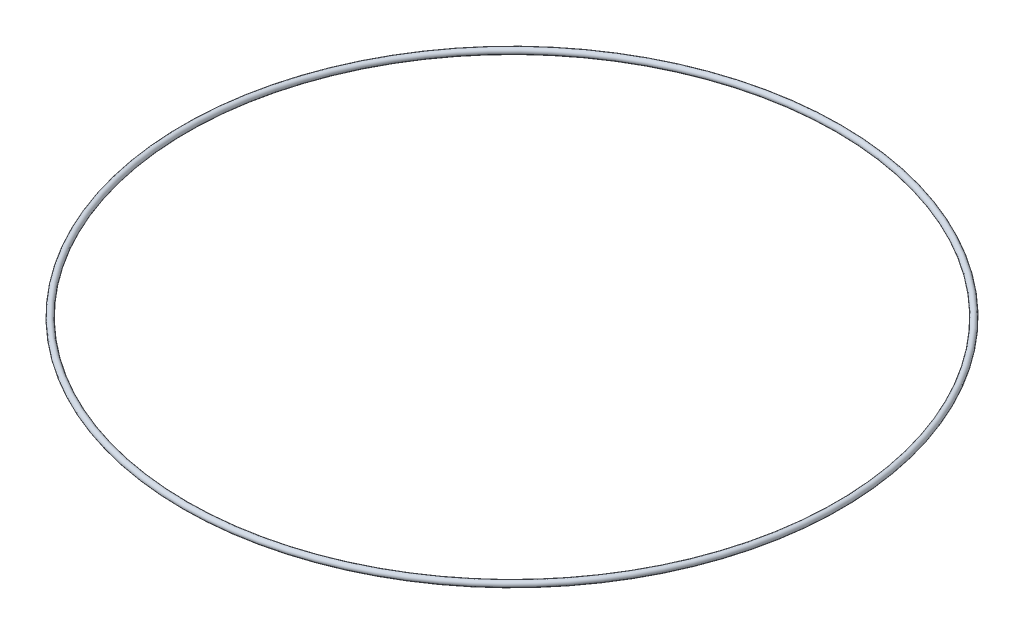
ISO-10303-21;
HEADER;
FILE_DESCRIPTION(('STEP AP214'),'2;1');
FILE_NAME('part.step','',(''),(''),'','','');
FILE_SCHEMA(('AUTOMOTIVE_DESIGN { 1 0 10303 214 1 1 1 1 }'));
ENDSEC;
DATA;
#1=APPLICATION_CONTEXT('core data for automotive mechanical design processes');
#2=APPLICATION_PROTOCOL_DEFINITION('international standard','automotive_design',2000,#1);
#3=PRODUCT_CONTEXT('',#1,'mechanical');
#4=PRODUCT('Part','Part','',(#3));
#5=PRODUCT_RELATED_PRODUCT_CATEGORY('part','',(#4));
#6=PRODUCT_DEFINITION_FORMATION('','',#4);
#7=PRODUCT_DEFINITION_CONTEXT('part definition',#1,'design');
#8=PRODUCT_DEFINITION('design','',#6,#7);
#9=PRODUCT_DEFINITION_SHAPE('','',#8);
#10=(LENGTH_UNIT() NAMED_UNIT(*) SI_UNIT(.MILLI.,.METRE.));
#11=(NAMED_UNIT(*) PLANE_ANGLE_UNIT() SI_UNIT($,.RADIAN.));
#12=(NAMED_UNIT(*) SI_UNIT($,.STERADIAN.) SOLID_ANGLE_UNIT());
#13=UNCERTAINTY_MEASURE_WITH_UNIT(LENGTH_MEASURE(1.E-05),#10,'distance_accuracy_value','');
#14=(GEOMETRIC_REPRESENTATION_CONTEXT(3) GLOBAL_UNCERTAINTY_ASSIGNED_CONTEXT((#13)) GLOBAL_UNIT_ASSIGNED_CONTEXT((#10,
#11,#12)) REPRESENTATION_CONTEXT('',''));
#15=CARTESIAN_POINT('',(0.,0.,0.));
#16=DIRECTION('',(0.,0.,1.));
#17=DIRECTION('',(1.,0.,0.));
#18=AXIS2_PLACEMENT_3D('',#15,#16,#17);
#19=CARTESIAN_POINT('',(0.,0.,0.));
#20=DIRECTION('',(0.,1.,0.));
#21=DIRECTION('',(0.,0.,0.999999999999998));
#22=AXIS2_PLACEMENT_3D('',#19,#20,#21);
#23=TOROIDAL_SURFACE('',#22,294.005,2.66699999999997);
#24=CARTESIAN_POINT('',(9.55179046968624E-13,1.90628994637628E-13,296.672));
#25=VERTEX_POINT('',#24);
#26=VERTEX_LOOP('',#25);
#27=FACE_BOUND('',#26,.T.);
#28=ADVANCED_FACE('F30',(#27),#23,.T.);
#29=CLOSED_SHELL('',(#28));
#30=MANIFOLD_SOLID_BREP('B2',#29);
#31=ADVANCED_BREP_SHAPE_REPRESENTATION('',(#18,#30),#14);
#32=SHAPE_DEFINITION_REPRESENTATION(#9,#31);
ENDSEC;
END-ISO-10303-21;
